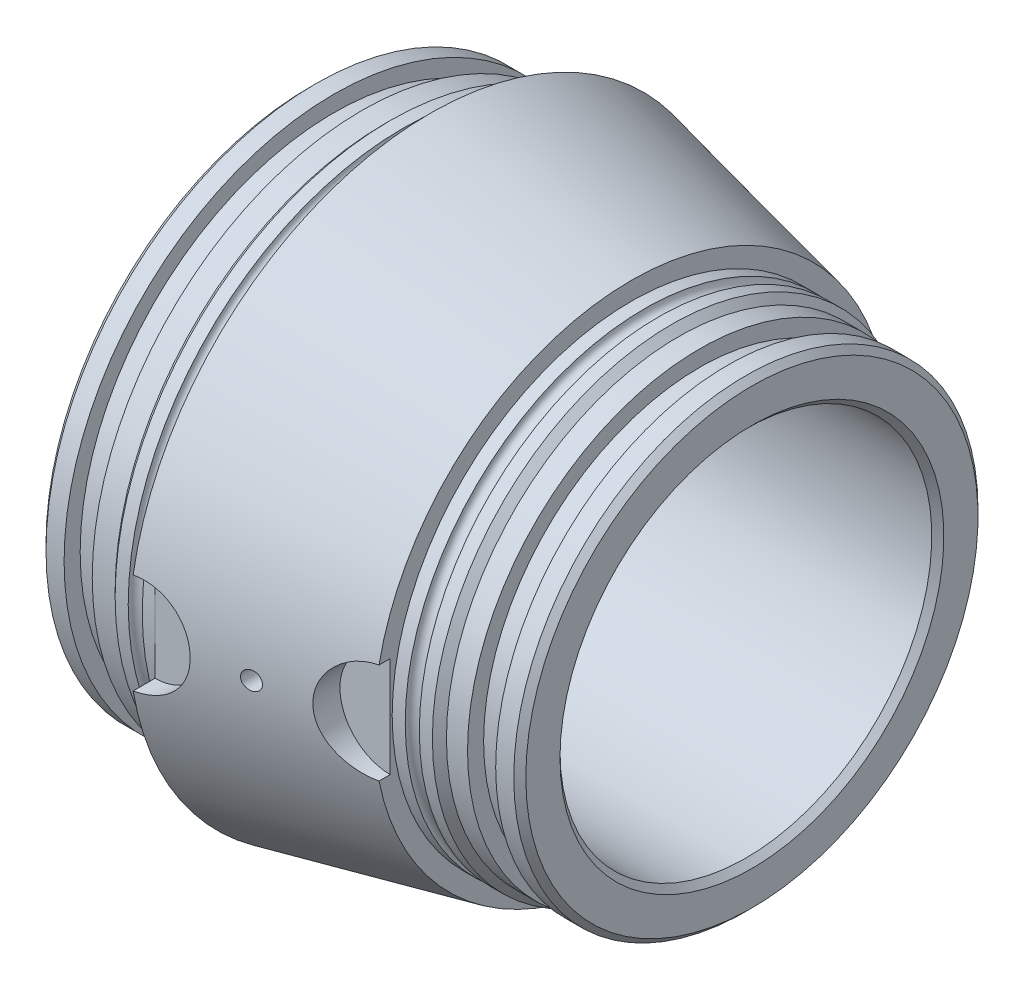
from build123d import *

# Parameters (mm, degrees)
CUT_EXTRUDE3_START = 34.798
SKETCH3_R          = 6.35
CUT_EXTRUDE3_DEPTH = 33.691477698
CUT_EXTRUDE4_START = 30.48
SKETCH3_3_R        = 6.35
CUT_EXTRUDE4_DEPTH = 38.009477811
CUT_EXTRUDE5_START = 30.48
SKETCH4_R          = 1.143
CUT_EXTRUDE5_DEPTH = 38.009477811


with BuildPart() as part:
    # Sketch1 → Revolve1 (revolve)
    with BuildSketch(Plane.XY, mode=Mode.PRIVATE) as revolve1_sk:
        with BuildLine():
            Line((-40.64, 33.3375), (-40.64, 24.257))
            Line((-40.64, 24.257), (-39.878, 23.495))
            Line((-39.878, 23.495), (14.478, 23.495))
            Line((14.478, 23.495), (15.24, 24.257))
            Line((15.24, 24.257), (15.24, 28.575))
            Line((15.24, 28.575), (14.478, 29.337))
            Line((14.478, 29.337), (12.192, 29.337))
            Line((12.192, 29.337), (12.192, 27.305))
            Line((12.192, 27.305), (8.636, 27.305))
            Line((8.636, 27.305), (8.636, 29.337))
            Line((8.636, 29.337), (5.969, 29.337))
            Line((5.969, 29.337), (5.08, 30.226))
            Line((5.08, 30.226), (3.429, 30.226))
            ThreePointArc((3.429, 30.226), (2.54, 29.337), (1.651, 30.226))
            Line((1.651, 30.226), (0, 30.226))
            Line((0, 30.226), (0, 32.512))
            Line((0, 32.512), (-25.4, 38.1))
            Line((-25.4, 38.1), (-25.4, 34.7599))
            Line((-25.4, 34.7599), (-27.051, 34.7599))
            ThreePointArc((-27.051, 34.7599), (-27.94, 33.8709), (-28.829, 34.7599))
            Line((-28.829, 34.7599), (-30.48, 34.7599))
            Line((-30.48, 34.7599), (-31.1404, 34.0995))
            Line((-31.1404, 34.0995), (-34.036, 34.0995))
            Line((-34.036, 34.0995), (-34.036, 32.0675))
            Line((-34.036, 32.0675), (-37.592, 32.0675))
            Line((-37.592, 32.0675), (-37.592, 34.0995))
            Line((-37.592, 34.0995), (-39.878, 34.0995))
            Line((-39.878, 34.0995), (-40.64, 33.3375))
        make_face()
    revolve(revolve1_sk.sketch.rotate(Axis((-43.059125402, 0, 0), (1, 0, 0)), 90), axis=Axis((-43.059125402, 0, 0), (1, 0, 0)))

    # Sketch3 → Cut-Extrude3 (cut, through all)
    with BuildSketch(Plane.XY.offset(CUT_EXTRUDE3_START)):
        with Locations((-25.4, 0)):
            Circle(SKETCH3_R)
    extrude(amount=CUT_EXTRUDE3_DEPTH, mode=Mode.SUBTRACT)

    # Sketch3_3 → Cut-Extrude4 (cut, through all)
    with BuildSketch(Plane.XY.offset(CUT_EXTRUDE4_START)):
        Circle(SKETCH3_3_R)
    extrude(amount=CUT_EXTRUDE4_DEPTH, mode=Mode.SUBTRACT)

    # Sketch4 → Cut-Extrude5 (cut, through all)
    with BuildSketch(Plane.XY.offset(CUT_EXTRUDE5_START)):
        with Locations(Location((-12.7, 0, 0), (0, 0, 213.050853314))):
            Circle(SKETCH4_R)
    extrude(amount=CUT_EXTRUDE5_DEPTH, mode=Mode.SUBTRACT)


solid = part.part
